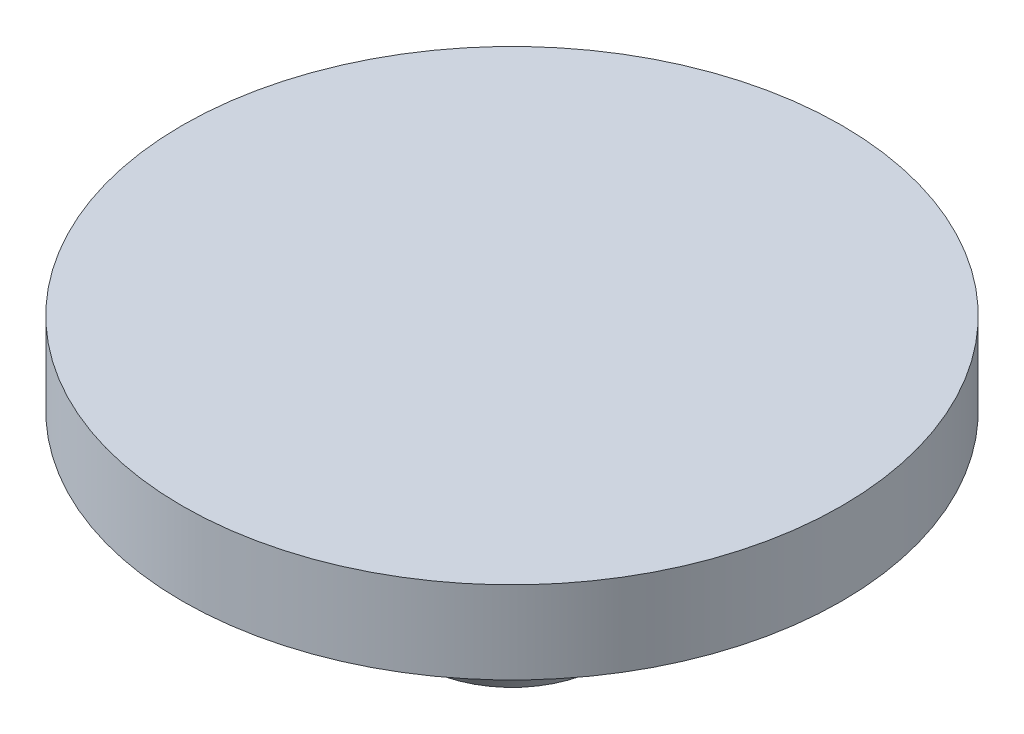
ISO-10303-21;
HEADER;
FILE_DESCRIPTION(('STEP AP214'),'2;1');
FILE_NAME('part.step','',(''),(''),'','','');
FILE_SCHEMA(('AUTOMOTIVE_DESIGN { 1 0 10303 214 1 1 1 1 }'));
ENDSEC;
DATA;
#1=APPLICATION_CONTEXT('core data for automotive mechanical design processes');
#2=APPLICATION_PROTOCOL_DEFINITION('international standard','automotive_design',2000,#1);
#3=PRODUCT_CONTEXT('',#1,'mechanical');
#4=PRODUCT('Part','Part','',(#3));
#5=PRODUCT_RELATED_PRODUCT_CATEGORY('part','',(#4));
#6=PRODUCT_DEFINITION_FORMATION('','',#4);
#7=PRODUCT_DEFINITION_CONTEXT('part definition',#1,'design');
#8=PRODUCT_DEFINITION('design','',#6,#7);
#9=PRODUCT_DEFINITION_SHAPE('','',#8);
#10=(LENGTH_UNIT() NAMED_UNIT(*) SI_UNIT(.MILLI.,.METRE.));
#11=(NAMED_UNIT(*) PLANE_ANGLE_UNIT() SI_UNIT($,.RADIAN.));
#12=(NAMED_UNIT(*) SI_UNIT($,.STERADIAN.) SOLID_ANGLE_UNIT());
#13=UNCERTAINTY_MEASURE_WITH_UNIT(LENGTH_MEASURE(1.E-05),#10,'distance_accuracy_value','');
#14=(GEOMETRIC_REPRESENTATION_CONTEXT(3) GLOBAL_UNCERTAINTY_ASSIGNED_CONTEXT((#13)) GLOBAL_UNIT_ASSIGNED_CONTEXT((#10,
#11,#12)) REPRESENTATION_CONTEXT('',''));
#15=CARTESIAN_POINT('',(0.,0.,0.));
#16=DIRECTION('',(0.,0.,1.));
#17=DIRECTION('',(1.,0.,0.));
#18=AXIS2_PLACEMENT_3D('',#15,#16,#17);
#19=CARTESIAN_POINT('',(0.,0.,0.));
#20=DIRECTION('',(0.,1.,0.));
#21=DIRECTION('',(0.,0.,1.));
#22=AXIS2_PLACEMENT_3D('',#19,#20,#21);
#23=PLANE('',#22);
#24=CARTESIAN_POINT('',(0.,0.,0.));
#25=DIRECTION('',(0.,1.,0.));
#26=DIRECTION('',(0.,0.,1.));
#27=AXIS2_PLACEMENT_3D('',#24,#25,#26);
#28=CIRCLE('',#27,12.7);
#29=CARTESIAN_POINT('',(0.,0.,12.7));
#30=VERTEX_POINT('',#29);
#31=EDGE_CURVE('E44',#30,#30,#28,.T.);
#32=ORIENTED_EDGE('',*,*,#31,.F.);
#33=EDGE_LOOP('',(#32));
#34=FACE_BOUND('',#33,.T.);
#35=CARTESIAN_POINT('',(0.,0.,0.));
#36=DIRECTION('',(0.,1.,0.));
#37=DIRECTION('',(0.,0.,1.));
#38=AXIS2_PLACEMENT_3D('',#35,#36,#37);
#39=CIRCLE('',#38,4.7625);
#40=CARTESIAN_POINT('',(0.,0.,4.7625));
#41=VERTEX_POINT('',#40);
#42=EDGE_CURVE('E10',#41,#41,#39,.F.);
#43=ORIENTED_EDGE('',*,*,#42,.F.);
#44=EDGE_LOOP('',(#43));
#45=FACE_BOUND('',#44,.T.);
#46=ADVANCED_FACE('F33',(#34,#45),#23,.F.);
#47=CARTESIAN_POINT('',(0.,3.175,0.));
#48=DIRECTION('',(0.,-1.,0.));
#49=DIRECTION('',(0.,0.,-1.));
#50=AXIS2_PLACEMENT_3D('',#47,#48,#49);
#51=CYLINDRICAL_SURFACE('',#50,12.7);
#52=CARTESIAN_POINT('',(0.,3.175,0.));
#53=DIRECTION('',(0.,1.,0.));
#54=DIRECTION('',(0.,0.,1.));
#55=AXIS2_PLACEMENT_3D('',#52,#53,#54);
#56=CIRCLE('',#55,12.7);
#57=CARTESIAN_POINT('',(0.,3.175,12.7));
#58=VERTEX_POINT('',#57);
#59=EDGE_CURVE('E40',#58,#58,#56,.T.);
#60=ORIENTED_EDGE('',*,*,#59,.F.);
#61=EDGE_LOOP('',(#60));
#62=FACE_BOUND('',#61,.T.);
#63=ORIENTED_EDGE('',*,*,#31,.T.);
#64=EDGE_LOOP('',(#63));
#65=FACE_BOUND('',#64,.T.);
#66=ADVANCED_FACE('F35',(#62,#65),#51,.T.);
#67=CARTESIAN_POINT('',(0.,3.175,0.));
#68=DIRECTION('',(0.,1.,0.));
#69=DIRECTION('',(0.,0.,1.));
#70=AXIS2_PLACEMENT_3D('',#67,#68,#69);
#71=PLANE('',#70);
#72=ORIENTED_EDGE('',*,*,#59,.T.);
#73=EDGE_LOOP('',(#72));
#74=FACE_BOUND('',#73,.T.);
#75=ADVANCED_FACE('F80',(#74),#71,.T.);
#76=CARTESIAN_POINT('',(0.,-1.5875,0.));
#77=DIRECTION('',(0.,1.,0.));
#78=DIRECTION('',(0.,0.,1.));
#79=AXIS2_PLACEMENT_3D('',#76,#77,#78);
#80=CYLINDRICAL_SURFACE('',#79,4.7625);
#81=CARTESIAN_POINT('',(0.,-1.5875,0.));
#82=DIRECTION('',(0.,-1.,0.));
#83=DIRECTION('',(0.,0.,-1.));
#84=AXIS2_PLACEMENT_3D('',#81,#82,#83);
#85=CIRCLE('',#84,4.7625);
#86=CARTESIAN_POINT('',(0.,-1.5875,-4.7625));
#87=VERTEX_POINT('',#86);
#88=EDGE_CURVE('E49',#87,#87,#85,.T.);
#89=ORIENTED_EDGE('',*,*,#88,.F.);
#90=EDGE_LOOP('',(#89));
#91=FACE_BOUND('',#90,.T.);
#92=ORIENTED_EDGE('',*,*,#42,.T.);
#93=EDGE_LOOP('',(#92));
#94=FACE_BOUND('',#93,.T.);
#95=ADVANCED_FACE('F87',(#91,#94),#80,.T.);
#96=CARTESIAN_POINT('',(0.,-1.5875,0.));
#97=DIRECTION('',(0.,-1.,0.));
#98=DIRECTION('',(0.,0.,-1.));
#99=AXIS2_PLACEMENT_3D('',#96,#97,#98);
#100=PLANE('',#99);
#101=CARTESIAN_POINT('',(0.,-1.5875,0.));
#102=DIRECTION('',(0.,1.,0.));
#103=DIRECTION('',(0.,0.,1.));
#104=AXIS2_PLACEMENT_3D('',#101,#102,#103);
#105=CIRCLE('',#104,6.35);
#106=CARTESIAN_POINT('',(0.,-1.5875,6.35));
#107=VERTEX_POINT('',#106);
#108=EDGE_CURVE('E56',#107,#107,#105,.T.);
#109=ORIENTED_EDGE('',*,*,#108,.T.);
#110=EDGE_LOOP('',(#109));
#111=FACE_BOUND('',#110,.T.);
#112=ORIENTED_EDGE('',*,*,#88,.T.);
#113=EDGE_LOOP('',(#112));
#114=FACE_BOUND('',#113,.T.);
#115=ADVANCED_FACE('F60',(#111,#114),#100,.F.);
#116=CARTESIAN_POINT('',(0.,-6.7056,0.));
#117=DIRECTION('',(0.,1.,0.));
#118=DIRECTION('',(0.,0.,1.));
#119=AXIS2_PLACEMENT_3D('',#116,#117,#118);
#120=CONICAL_SURFACE('',#119,3.5687,0.497780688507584);
#121=ORIENTED_EDGE('',*,*,#108,.F.);
#122=EDGE_LOOP('',(#121));
#123=FACE_BOUND('',#122,.T.);
#124=CARTESIAN_POINT('',(0.,-6.7056,0.));
#125=DIRECTION('',(0.,1.,0.));
#126=DIRECTION('',(0.,0.,1.));
#127=AXIS2_PLACEMENT_3D('',#124,#125,#126);
#128=CIRCLE('',#127,3.5687);
#129=CARTESIAN_POINT('',(0.,-6.7056,3.5687));
#130=VERTEX_POINT('',#129);
#131=EDGE_CURVE('E53',#130,#130,#128,.T.);
#132=ORIENTED_EDGE('',*,*,#131,.T.);
#133=EDGE_LOOP('',(#132));
#134=FACE_BOUND('',#133,.T.);
#135=ADVANCED_FACE('F63',(#123,#134),#120,.T.);
#136=CARTESIAN_POINT('',(0.,-6.7056,0.));
#137=DIRECTION('',(0.,1.,0.));
#138=DIRECTION('',(0.,0.,1.));
#139=AXIS2_PLACEMENT_3D('',#136,#137,#138);
#140=PLANE('',#139);
#141=ORIENTED_EDGE('',*,*,#131,.F.);
#142=EDGE_LOOP('',(#141));
#143=FACE_BOUND('',#142,.T.);
#144=ADVANCED_FACE('F66',(#143),#140,.F.);
#145=CLOSED_SHELL('',(#46,#66,#75,#95,#115,#135,#144));
#146=MANIFOLD_SOLID_BREP('B2',#145);
#147=ADVANCED_BREP_SHAPE_REPRESENTATION('',(#18,#146),#14);
#148=SHAPE_DEFINITION_REPRESENTATION(#9,#147);
ENDSEC;
END-ISO-10303-21;
